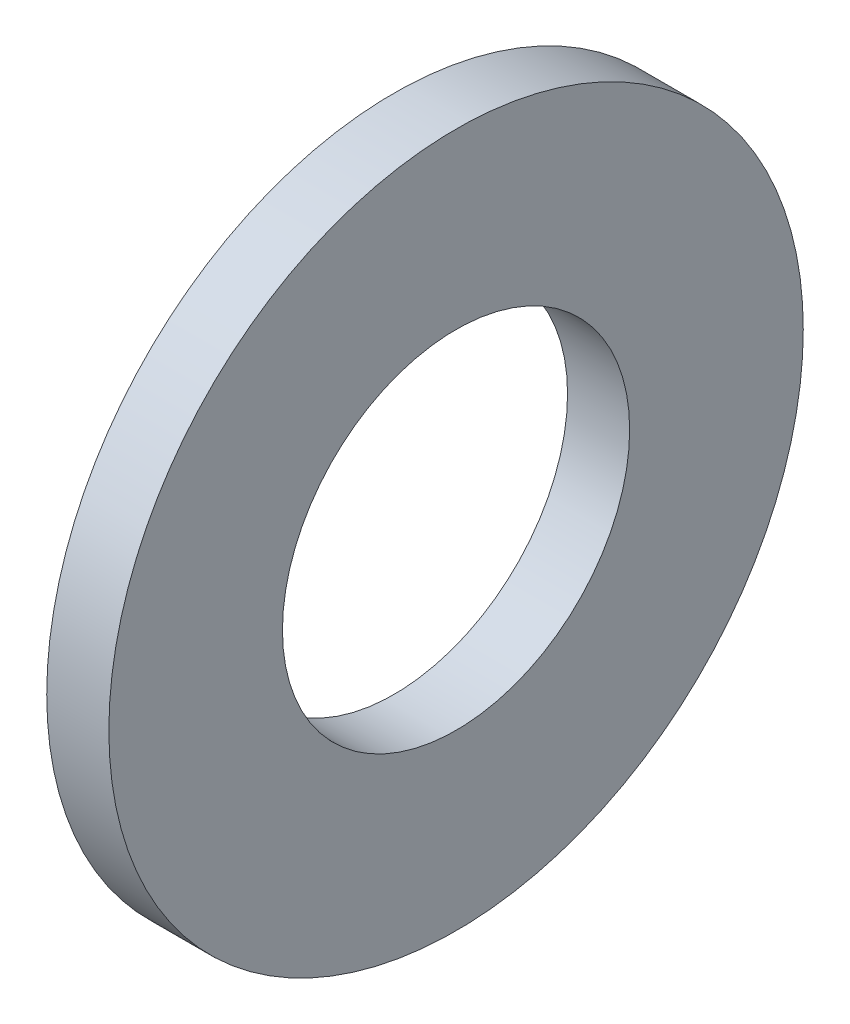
from build123d import *

# Parameters (mm, degrees)
SKETCH1_W = 2.413
SKETCH1_H = 6.7437


with BuildPart() as part:
    # Sketch1 → Base-Revolve (revolve)
    with BuildSketch(Plane.XY, mode=Mode.PRIVATE) as base_revolve_sk:
        with Locations((-1.2065, 10.11555)):
            Rectangle(SKETCH1_W, SKETCH1_H)
    revolve(base_revolve_sk.sketch.rotate(Axis((-34.925, 0, 0), (1, 0, 0)), 90), axis=Axis((-34.925, 0, 0), (1, 0, 0)))


solid = part.part
